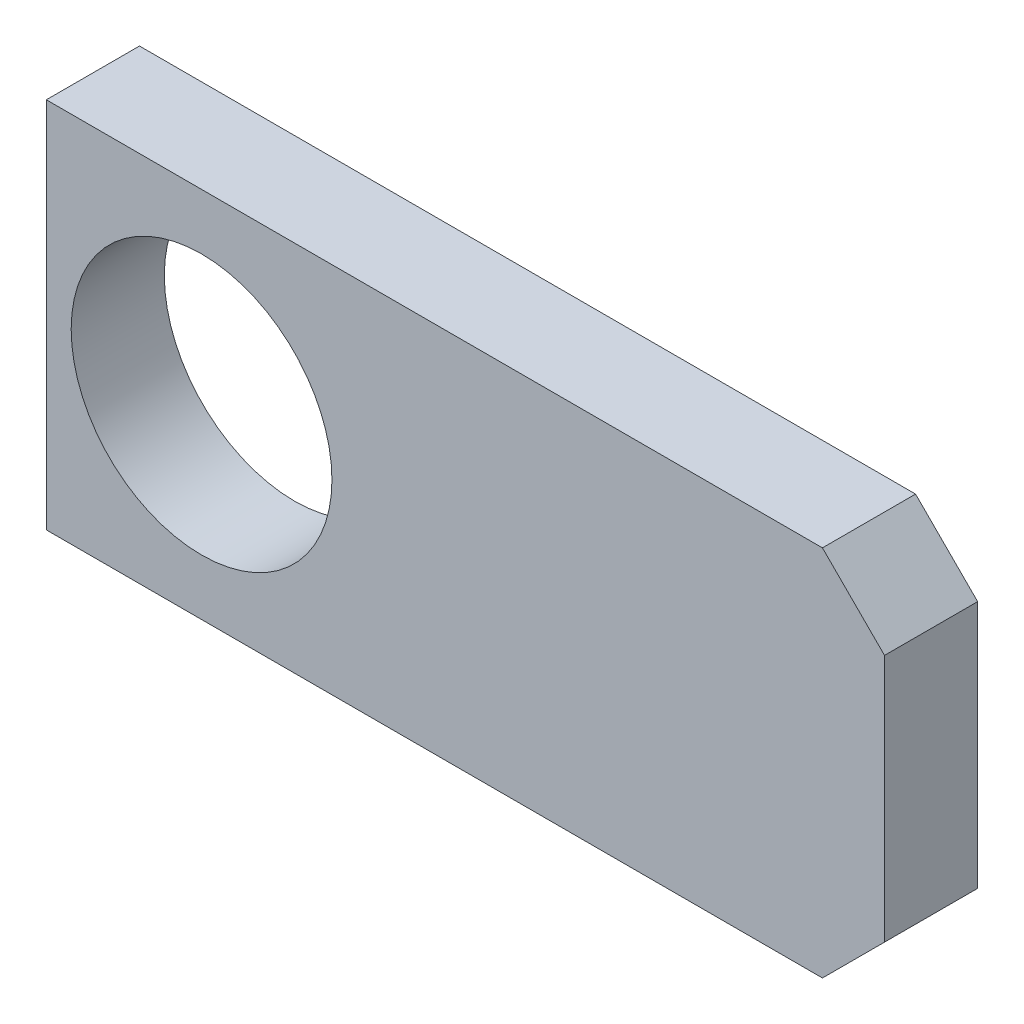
from build123d import *

# Parameters (mm, degrees)
ESQUISSE1_W             = 135
ESQUISSE1_H             = 60
BASE_EXTRUSION_DEPTH    = 15
ESQUISSE2_R             = 21
ENL_V_MAT_EXTRU_1_DEPTH = 149.492424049
CHANFREIN1_SIZE         = 10


with BuildPart() as part:
    # Esquisse1 → Base-Extrusion (new body)
    with BuildSketch(Plane.XY):
        with Locations((67.5, 30)):
            Rectangle(ESQUISSE1_W, ESQUISSE1_H)
    extrude(amount=BASE_EXTRUSION_DEPTH)

    # Esquisse2 → Enl_v. mat.-Extru.1 (cut, through all)
    with BuildSketch(Plane.XY.offset(15)):
        with Locations((25, 30)):
            Circle(ESQUISSE2_R)
    extrude(amount=-ENL_V_MAT_EXTRU_1_DEPTH, mode=Mode.SUBTRACT)

    # Chanfrein1
    chanfrein1_edges = [part.edges().sort_by_distance(p)[0] for p in [
        (135, 0, 7.5),
        (135, 60, 7.5),
    ]]
    chamfer(chanfrein1_edges, length=CHANFREIN1_SIZE)


solid = part.part
